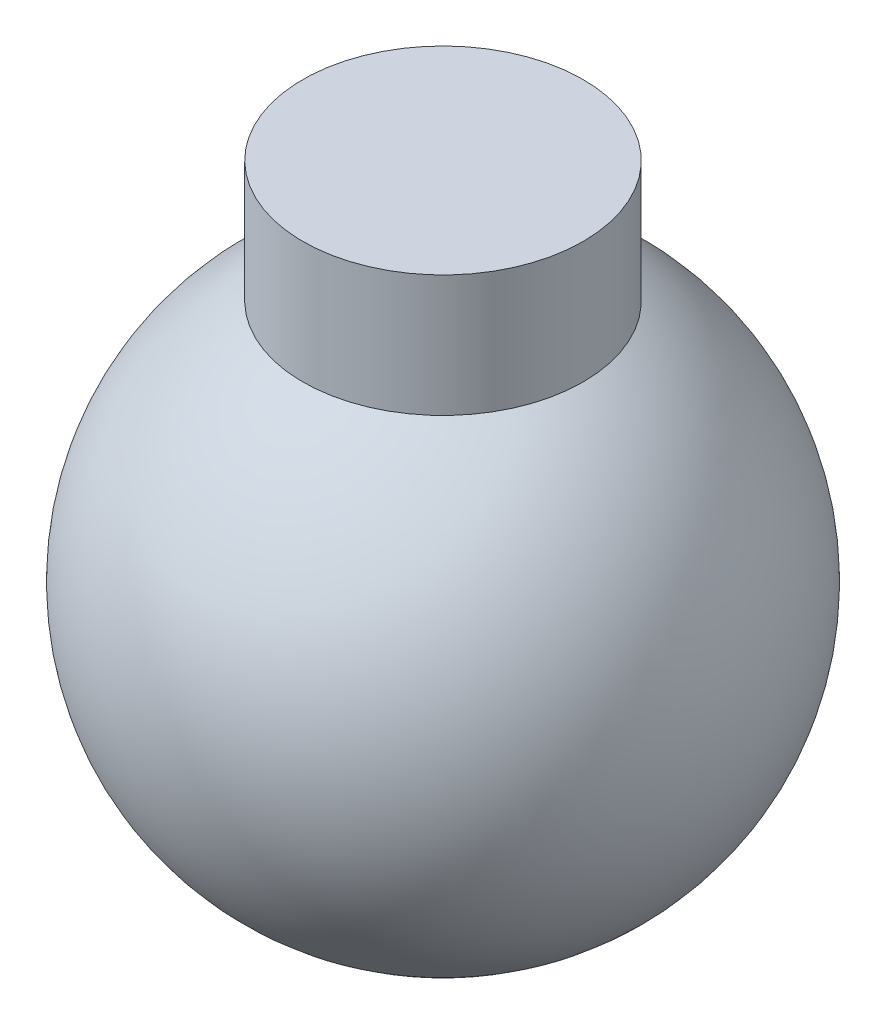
from build123d import *


with BuildPart() as part:
    # Sketch1 → Revolve1 (revolve)
    with BuildSketch(Plane.XY):
        with BuildLine():
            Line((2.5, 4.330127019), (2.5, 6.5))
            Line((2.5, 6.5), (0, 6.5))
            Line((0, 6.5), (0, -5))
            ThreePointArc((0, -5), (4.829629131, -1.294095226), (2.5, 4.330127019))
        make_face()
    revolve(axis=Axis((0, -5, 0), (0, 1, 0)))


solid = part.part
